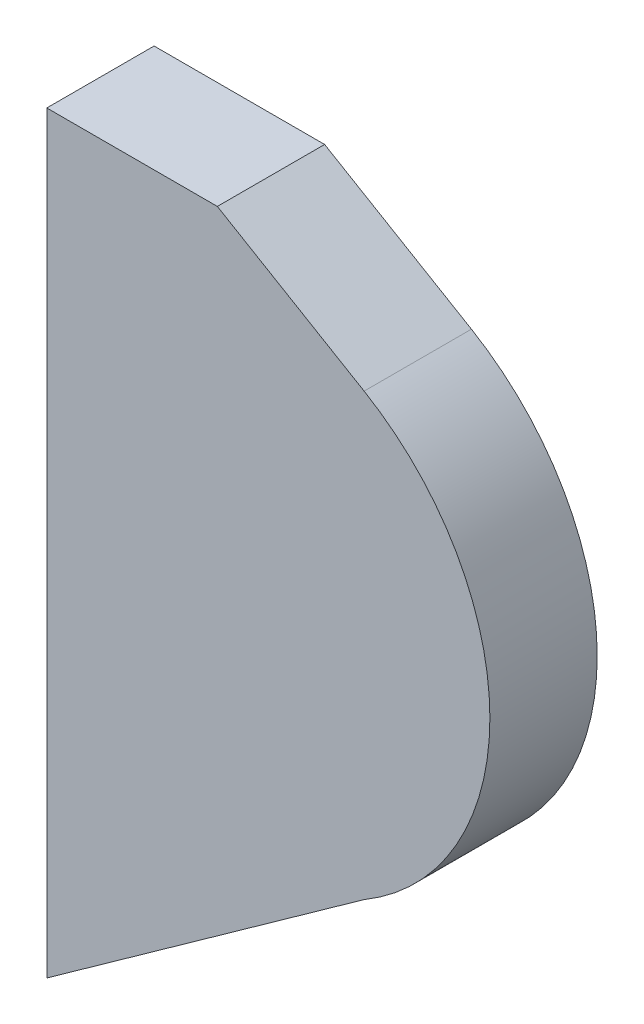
from build123d import *

# Parameters (mm, degrees)
EXTRUDE1_DEPTH = 5


with BuildPart() as part:
    # Sketch1 → Extrude1 (new body)
    with BuildSketch(Plane.XY):
        with BuildLine():
            Line((0, 0), (0, 35.111935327))
            Line((0, 35.111935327), (7.947318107, 35.111935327))
            Line((7.947318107, 35.111935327), (14.787492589, 31.077986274))
            ThreePointArc((14.787492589, 31.077986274), (20.648187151, 20.817724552), (14.787492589, 10.55746283))
            Line((14.787492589, 10.55746283), (0, 0))
        make_face()
    extrude(amount=EXTRUDE1_DEPTH)


solid = part.part
